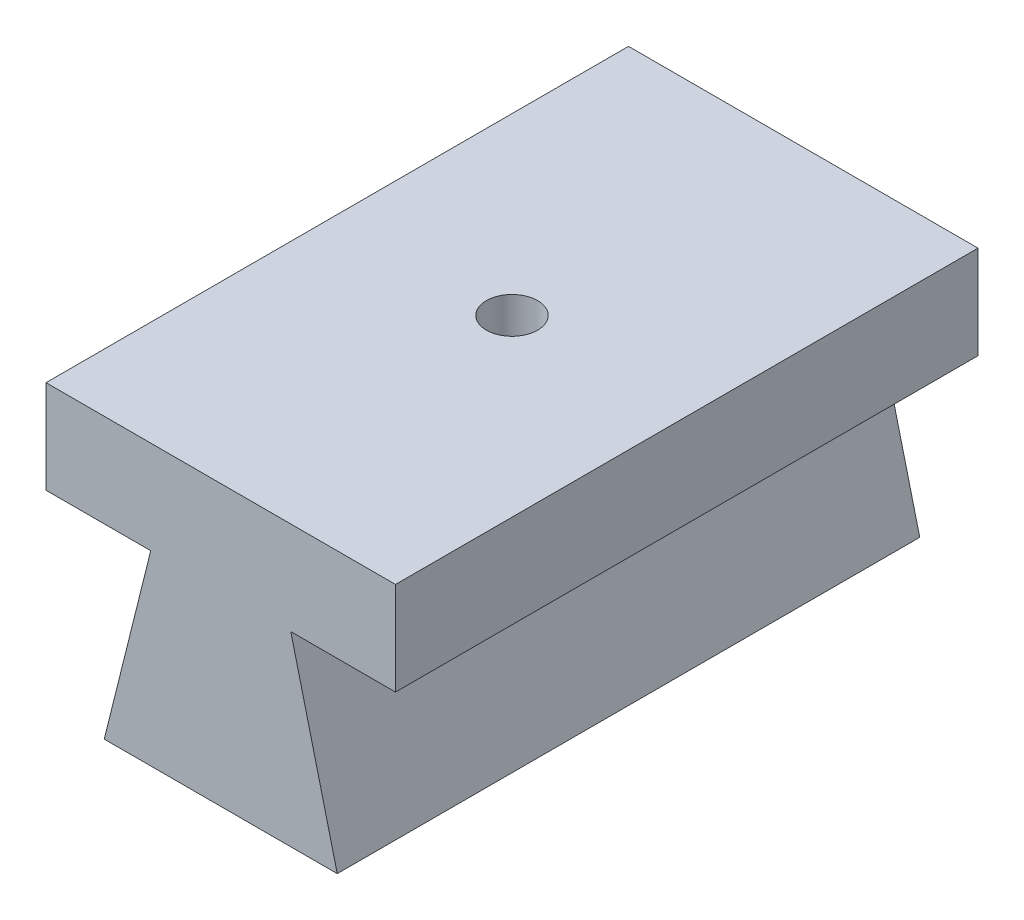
from build123d import *

# Parameters (mm, degrees)
BASE_EXTRUDE_DEPTH = 15.875
SKETCH3_R          = 1.397
CUT_EXTRUDE2_DEPTH = 12.7


with BuildPart() as part:
    # Sketch1 → Base-Extrude (new, symmetric)
    with BuildSketch(Plane.XY):
        Polygon((6.35, 0), (-6.35, 0), (-3.816827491, 10.16), (-9.525, 10.16), (-9.525, 15.24), (9.525, 15.24), (9.525, 10.16), (3.816827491, 10.16), align=None)
    extrude(amount=BASE_EXTRUDE_DEPTH, both=True)

    # Sketch3 → Cut-Extrude2 (cut)
    with BuildSketch(Plane(origin=(0, 15.24, 0), x_dir=(-1, 0, 0), z_dir=(0, 1, 0))):
        with Locations(Location((0, 0, 0), (0, 0, 90))):
            Circle(SKETCH3_R)
    extrude(amount=-CUT_EXTRUDE2_DEPTH, mode=Mode.SUBTRACT)


solid = part.part
